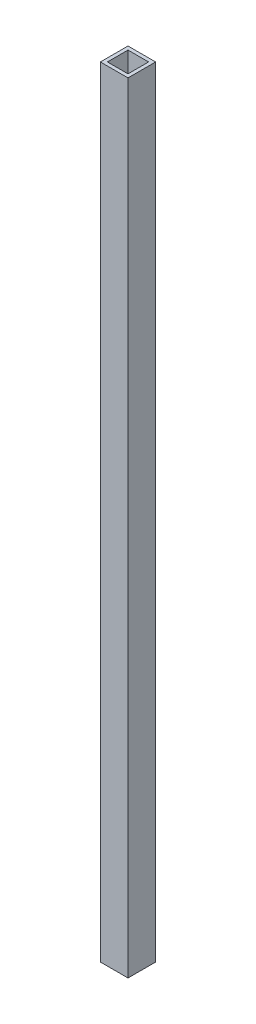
from build123d import *

# Parameters (mm, degrees)
SKETCH1_W           = 12.6
SKETCH1_H           = 12.6
SKETCH1_W_2         = 9.4
SKETCH1_H_2         = 9.4
BOSS_EXTRUDE1_DEPTH = 355.6


with BuildPart() as part:
    # Sketch1 → Boss-Extrude1 (new body)
    with BuildSketch(Plane(origin=(0, 0, 0), x_dir=(1, 0, 0), z_dir=(0, 1, 0))):
        with Locations((6.3, 6.3)):
            Rectangle(SKETCH1_W, SKETCH1_H)
        with Locations((6.3, 6.3)):
            Rectangle(SKETCH1_W_2, SKETCH1_H_2, mode=Mode.SUBTRACT)
    extrude(amount=BOSS_EXTRUDE1_DEPTH)


solid = part.part
